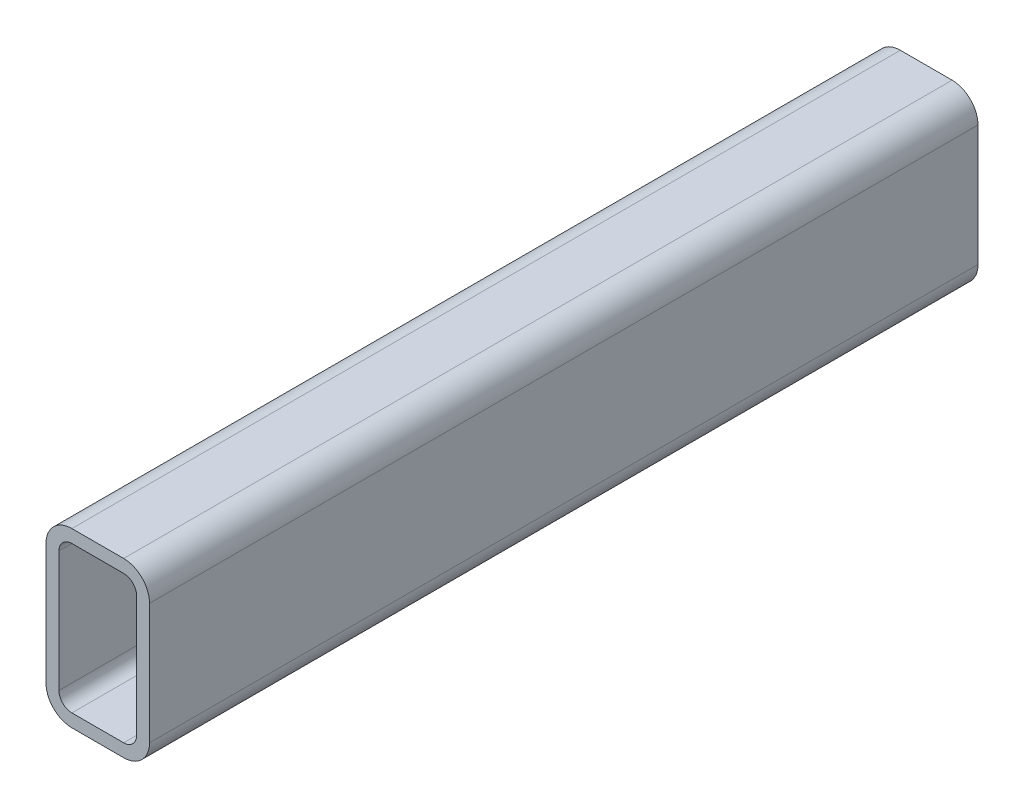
from build123d import *

# Parameters (mm, degrees)
BOSS_EXTRUDE1_DEPTH = 304.8


with BuildPart() as part:
    # Sketch1 → Boss-Extrude1 (new body)
    with BuildSketch(Plane.XY):
        with BuildLine():
            Line((38.1, 53.975), (38.1, 9.525))
            ThreePointArc((38.1, 9.525), (35.310192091, 2.789807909), (28.575, 0))
            Line((28.575, 0), (9.525, 0))
            ThreePointArc((9.525, 0), (2.789807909, 2.789807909), (0, 9.525))
            Line((0, 9.525), (0, 53.975))
            ThreePointArc((0, 53.975), (2.789807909, 60.710192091), (9.525, 63.5))
            Line((9.525, 63.5), (28.575, 63.5))
            ThreePointArc((28.575, 63.5), (35.310192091, 60.710192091), (38.1, 53.975))
        make_face()
        with BuildLine():
            Line((4.7625, 9.525), (4.7625, 53.975))
            ThreePointArc((4.7625, 53.975), (6.157403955, 57.342596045), (9.525, 58.7375))
            Line((9.525, 58.7375), (28.575, 58.7375))
            ThreePointArc((28.575, 58.7375), (31.942596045, 57.342596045), (33.3375, 53.975))
            Line((33.3375, 53.975), (33.3375, 9.525))
            ThreePointArc((33.3375, 9.525), (31.942596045, 6.157403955), (28.575, 4.7625))
            Line((28.575, 4.7625), (9.525, 4.7625))
            ThreePointArc((9.525, 4.7625), (6.157403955, 6.157403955), (4.7625, 9.525))
        make_face(mode=Mode.SUBTRACT)
    extrude(amount=BOSS_EXTRUDE1_DEPTH)


solid = part.part
